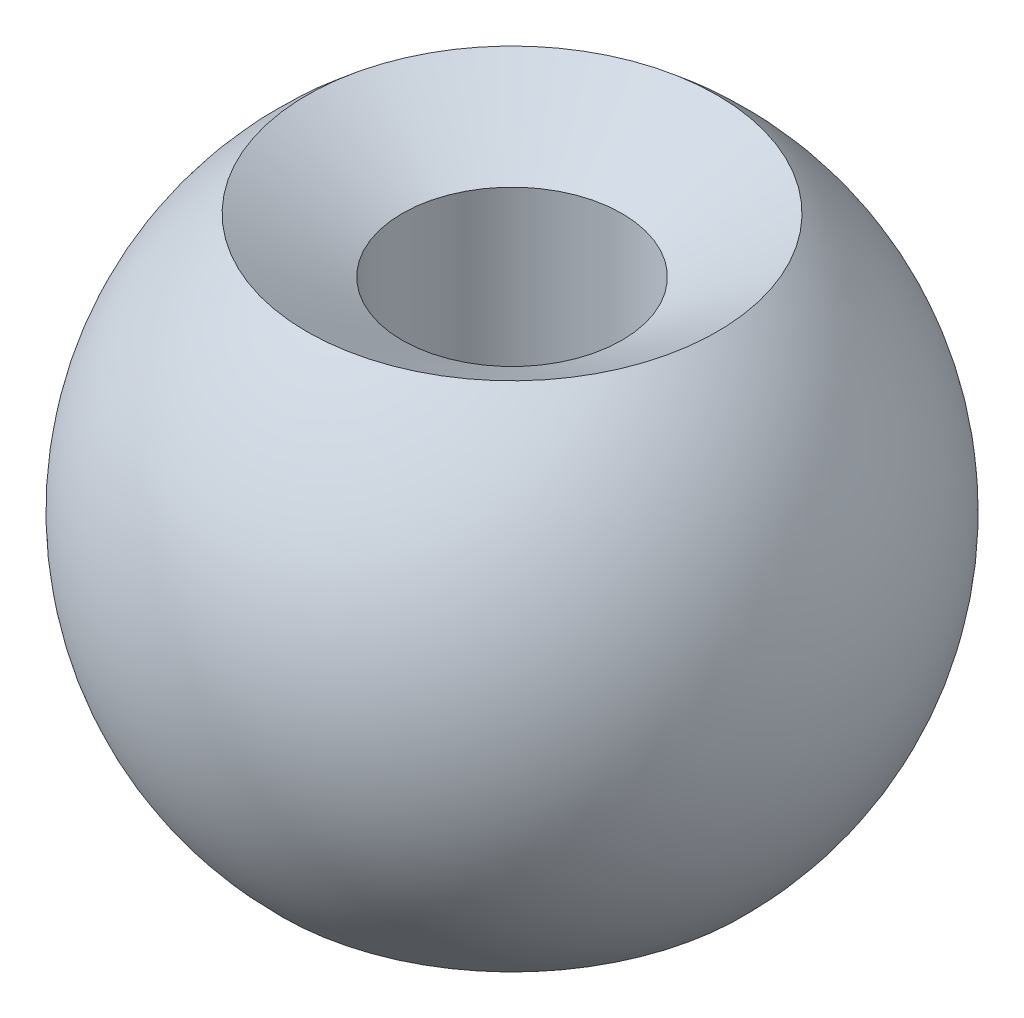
from build123d import *


with BuildPart() as part:
    # Sketch1 → Revolve1 (revolve)
    with BuildSketch(Plane.XY, mode=Mode.PRIVATE) as revolve1_sk:
        with BuildLine():
            Line((2, 0), (2, 8))
            Line((2, 8), (3.732050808, 9))
            ThreePointArc((3.732050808, 9), (5.992498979, 4.60186354), (4.182503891, 0))
            Line((4.182503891, 0), (2, 0))
        make_face()
    revolve(revolve1_sk.sketch.rotate(Axis((0, 0, 0), (0, 1, 0)), 90), axis=Axis((0, 0, 0), (0, 1, 0)))


solid = part.part
